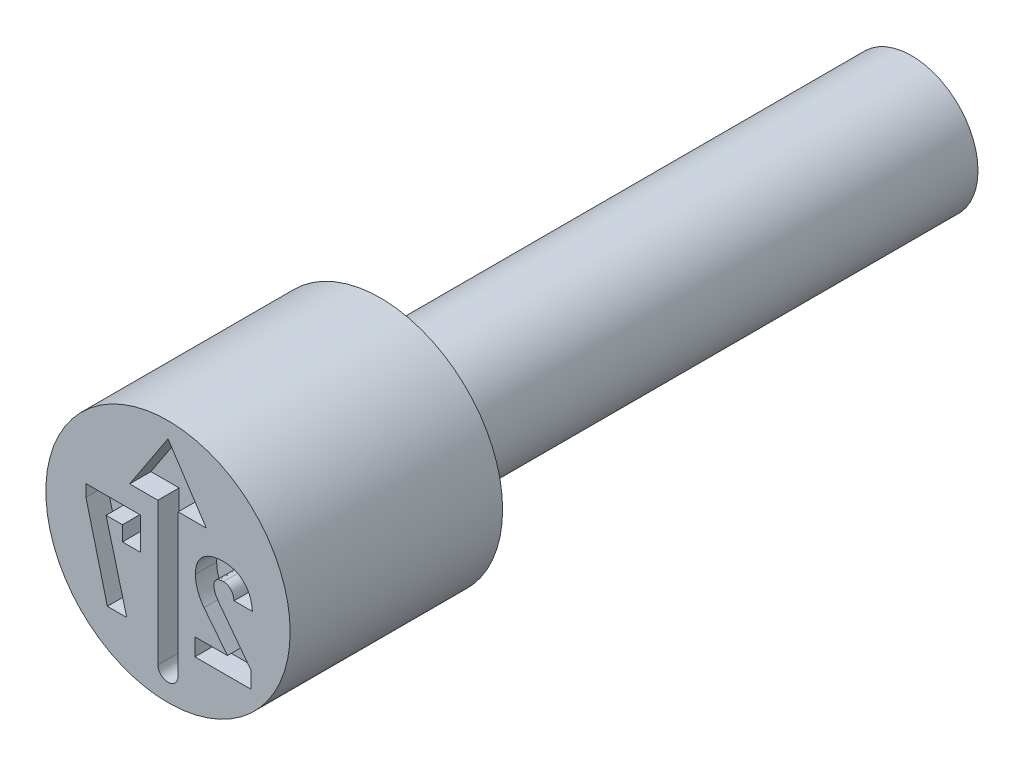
from build123d import *

# Parameters (mm, degrees)
CUT_EXTRUDE4_DEPTH = 0.4
CUT_EXTRUDE5_DEPTH = 0.4


with BuildPart() as part:
    # Sketch2 → Revolve1 (revolve)
    with BuildSketch(Plane(origin=(0, 0, 0), x_dir=(0, 0, -1), z_dir=(1, 0, 0)), mode=Mode.PRIVATE) as revolve1_sk:
        Polygon((0, 2.3), (0, 0), (14, 0), (14, 1.25), (4, 1.25), (4, 2.3), align=None)
    revolve(revolve1_sk.sketch.rotate(Axis((0, 0, -0.403888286), (0, 0, -1)), 90), axis=Axis((0, 0, -0.403888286), (0, 0, -1)))

    # Sketch3 → Cut-Extrude4 (cut)
    with BuildSketch(Plane.XY):
        with BuildLine():
            Line((0.190473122, 0.906351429), (0.190473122, -1.776161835))
            ThreePointArc((0.190473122, -1.776161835), (0, -1.966634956), (-0.190473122, -1.776161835))
            Line((-0.190473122, -1.776161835), (-0.190473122, 0.906351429))
            Line((-0.190473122, 0.906351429), (-0.721917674, 0.906351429))
            Line((-0.721917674, 0.906351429), (0, 2.002115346))
            Line((0, 2.002115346), (0.721917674, 0.906351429))
            Line((0.721917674, 0.906351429), (0.190473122, 0.906351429))
        make_face()
    extrude(amount=-CUT_EXTRUDE4_DEPTH, mode=Mode.SUBTRACT)

    # Sketch4 → Cut-Extrude5 (cut)
    with BuildSketch(Plane.XY):
        with BuildLine():
            Line((1.566680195, -1.3), (1.566680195, -0.993912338))
            Line((1.566680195, -0.993912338), (0.951582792, -0.179017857))
            add(Edge.make_bspline(
                [(0.951582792, -0.179017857), (0.938699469, -0.160864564), (0.913596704, -0.125493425), (0.890876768, -0.076918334), (0.876723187, -0.038834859), (0.869977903, -0.011216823), (0.865166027, 0.015133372), (0.864573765, 0.032447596), (0.864285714, 0.040868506)],
                knots=[0, 0, 0, 0, 1.664252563, 3.24274559, 3.998498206, 4.704056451, 5.369707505, 6, 6, 6, 6], degree=3))
            Line((0.864285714, 0.040868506), (0.864285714, 0.043425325))
            add(Edge.make_bspline(
                [(0.864285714, 0.043425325), (0.864784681, 0.054934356), (0.86574062, 0.076983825), (0.874747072, 0.10805196), (0.889508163, 0.13510756), (0.910649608, 0.157455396), (0.93696909, 0.17513119), (0.968461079, 0.187588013), (1.004713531, 0.194731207), (1.030445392, 0.19563044), (1.043993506, 0.196103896)],
                knots=[0, 0, 0, 0, 1.029992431, 1.973301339, 2.872554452, 3.768620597, 4.704316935, 5.693697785, 6.785705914, 8, 8, 8, 8], degree=3))
            add(Edge.make_bspline(
                [(1.043993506, 0.196103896), (1.057226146, 0.195587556), (1.082937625, 0.194584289), (1.119336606, 0.183465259), (1.152135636, 0.166024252), (1.180411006, 0.141138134), (1.203825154, 0.109892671), (1.222828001, 0.07309857), (1.235734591, 0.030091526), (1.24030008, -0.000694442), (1.242694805, -0.016842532)],
                knots=[0, 0, 0, 0, 0.980828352, 1.905783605, 2.800718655, 3.724477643, 4.680224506, 5.688112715, 6.78735127, 8, 8, 8, 8], degree=3))
            Line((1.242694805, -0.016842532), (1.242694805, -0.017938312))
            Line((1.242694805, -0.017938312), (1.588961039, -0.017938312))
            Line((1.588961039, -0.017938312), (1.588961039, -0.016842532))
            add(Edge.make_bspline(
                [(1.588961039, -0.016842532), (1.587252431, 0.004022), (1.583917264, 0.044749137), (1.572983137, 0.103662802), (1.558851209, 0.159155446), (1.540873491, 0.211216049), (1.51777206, 0.25924181), (1.4918169, 0.304236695), (1.460599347, 0.344809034), (1.42642736, 0.382316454), (1.388365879, 0.415352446), (1.347781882, 0.444494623), (1.304061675, 0.468745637), (1.257869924, 0.488863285), (1.208694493, 0.504132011), (1.157177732, 0.51556945), (1.102728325, 0.522165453), (1.065561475, 0.522966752), (1.046550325, 0.523376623)],
                knots=[0, 0, 0, 0, 1.173229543, 2.290119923, 3.354877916, 4.382703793, 5.372196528, 6.339367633, 7.289741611, 8.236749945, 9.180232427, 10.11040526, 11.033485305, 11.978374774, 12.930610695, 13.916256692, 14.93414813, 16, 16, 16, 16], degree=3))
            add(Edge.make_bspline(
                [(1.046550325, 0.523376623), (1.026079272, 0.52308583), (0.986265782, 0.522520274), (0.928304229, 0.51641528), (0.873768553, 0.507201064), (0.822746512, 0.493721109), (0.775442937, 0.476137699), (0.731716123, 0.454936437), (0.691474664, 0.429936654), (0.655026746, 0.401084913), (0.622232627, 0.368905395), (0.594005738, 0.333071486), (0.569570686, 0.294307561), (0.550469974, 0.251861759), (0.534744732, 0.206732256), (0.524562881, 0.15811011), (0.51770161, 0.10656779), (0.516945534, 0.071087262), (0.516558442, 0.052922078)],
                knots=[0, 0, 0, 0, 1.219700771, 2.37215663, 3.469774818, 4.513610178, 5.512457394, 6.473141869, 7.405450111, 8.330272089, 9.238546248, 10.1372905, 11.043445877, 11.962355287, 12.905558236, 13.886315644, 14.917844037, 16, 16, 16, 16], degree=3))
            Line((0.516558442, 0.052922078), (0.516558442, 0.051461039))
            add(Edge.make_bspline(
                [(0.516558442, 0.051461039), (0.517024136, 0.030980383), (0.517956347, -0.010017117), (0.526371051, -0.071375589), (0.539931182, -0.1324208), (0.558554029, -0.192857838), (0.58168837, -0.251639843), (0.60945403, -0.307961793), (0.640791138, -0.361848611), (0.665622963, -0.39510689), (0.678003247, -0.411688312)],
                knots=[0, 0, 0, 0, 0.984368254, 1.970475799, 2.971844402, 3.988480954, 5.008197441, 6.005725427, 7.005724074, 8, 8, 8, 8], degree=3))
            Line((0.678003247, -0.411688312), (1.119237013, -0.972727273))
            Line((1.119237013, -0.972727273), (0.506696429, -0.972727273))
            Line((0.506696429, -0.972727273), (0.506696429, -1.3))
            Line((0.506696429, -1.3), (1.566680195, -1.3))
        make_face()
        Polygon((-1.544032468, 0.5), (-1.544032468, 0.274269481), (-1.142246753, -1.3), (-0.776256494, -1.3), (-1.165623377, 0.172727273), (-0.857709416, 0.172727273), (-0.857709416, -0.107792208), (-0.519844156, -0.107792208), (-0.519844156, 0.5), align=None)
    extrude(amount=-CUT_EXTRUDE5_DEPTH, mode=Mode.SUBTRACT)


solid = part.part
